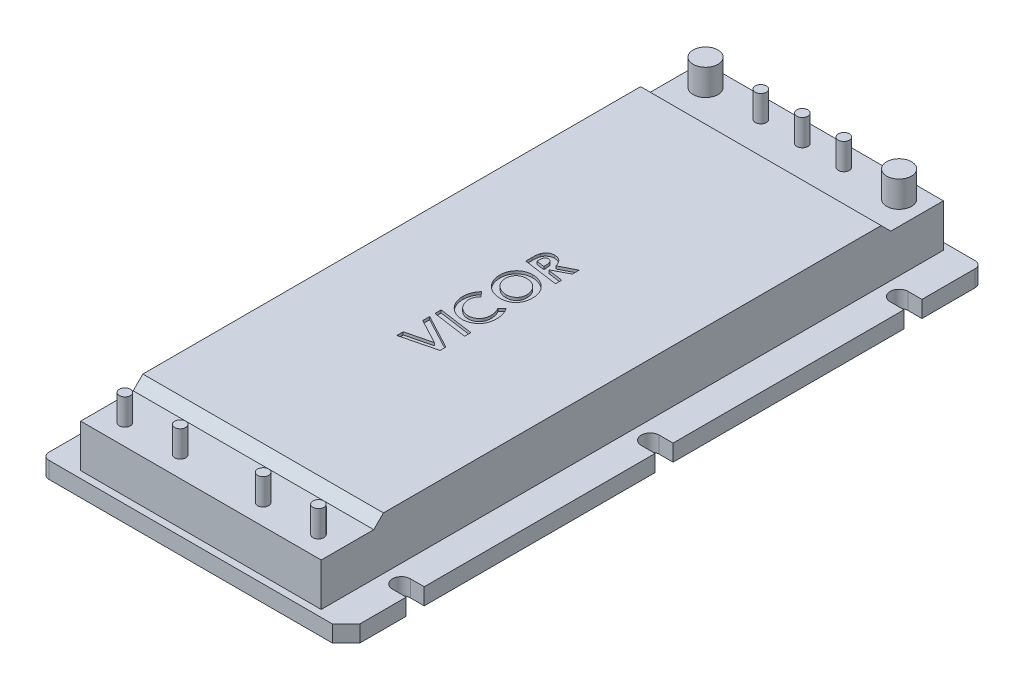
from build123d import *

# Parameters (mm, degrees)
SKETCH1_W            = 55.88
SKETCH1_H            = 116.84
EXTRUDE1_DEPTH       = 3.048
SKETCH2_W            = 44.196
SKETCH2_H            = 114.3
EXTRUDE2_DEPTH       = 9.652
CUT_EXTRUDE1_DEPTH   = 130.87425112
MIRROR3_COPY_1_DEPTH = 130.87425112
CHAMFER1_SIZE        = 2.54
FILLET1_R            = 1.27
CUT_EXTRUDE2_DEPTH   = 131.136274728
SKETCH6_R            = 1.016
SKETCH6_R_2          = 2.286
EXTRUDE4_DEPTH       = 4.826
CUT_EXTRUDE3_DEPTH   = 0.508


with BuildPart() as part:
    # Sketch1 → Extrude1 (new body)
    with BuildSketch(Plane(origin=(0, 0, 0), x_dir=(1, 0, 0), z_dir=(0, 1, 0))):
        with Locations((-27.94, 58.42)):
            Rectangle(SKETCH1_W, SKETCH1_H)
    extrude(amount=EXTRUDE1_DEPTH)

    # Sketch2 → Extrude2 (add)
    with BuildSketch(Plane(origin=(0, 3.048, 0), x_dir=(-1, 0, 0), z_dir=(0, 1, 0))):
        with Locations((27.94, -58.42)):
            Rectangle(SKETCH2_W, SKETCH2_H)
    extrude(amount=EXTRUDE2_DEPTH)

    # Sketch4 → Cut-Extrude1 (cut, through all)
    with BuildSketch(Plane(origin=(0, 3.048, 0), x_dir=(-1, 0, 0), z_dir=(0, 1, 0))):
        with BuildLine():
            Line((2.54, -56.769), (0, -56.769))
            Line((0, -56.769), (0, -60.071))
            Line((0, -60.071), (2.54, -60.071))
            ThreePointArc((2.54, -60.071), (4.191, -58.42), (2.54, -56.769))
        make_face()
        with BuildLine():
            Line((2.54, -11.049), (0, -11.049))
            Line((0, -11.049), (0, -14.351))
            Line((0, -14.351), (2.54, -14.351))
            ThreePointArc((2.54, -14.351), (4.191, -12.7), (2.54, -11.049))
        make_face()
    cut_extrude1 = extrude(amount=-CUT_EXTRUDE1_DEPTH, mode=Mode.SUBTRACT)

    # Mirror1: Cut-Extrude1 across plane
    add(cut_extrude1.mirror(Plane(origin=(0, 0, -58.42), x_dir=(1, 0, 0), z_dir=(0, 0, -1))), mode=Mode.SUBTRACT)

    # Mirror3: Cut-Extrude1 across plane
    add(cut_extrude1.mirror(Plane.ZY.offset(27.94)), mode=Mode.SUBTRACT)

    # Mirror3 copy 1 sketch → Mirror3 copy 1 (cut, through all)
    with BuildSketch(Plane(origin=(-55.88, 3.048, -116.84), x_dir=(1, 0, 0), z_dir=(0, 1, 0))):
        with BuildLine():
            Line((2.54, -56.769), (0, -56.769))
            Line((0, -56.769), (0, -60.071))
            Line((0, -60.071), (2.54, -60.071))
            ThreePointArc((2.54, -60.071), (4.191, -58.42), (2.54, -56.769))
        make_face()
        with BuildLine():
            Line((2.54, -11.049), (0, -11.049))
            Line((0, -11.049), (0, -14.351))
            Line((0, -14.351), (2.54, -14.351))
            ThreePointArc((2.54, -14.351), (4.191, -12.7), (2.54, -11.049))
        make_face()
    extrude(amount=-MIRROR3_COPY_1_DEPTH, mode=Mode.SUBTRACT)

    # Chamfer1
    chamfer1_edges = [part.edges().sort_by_distance(p)[0] for p in [
        (0, 1.524, 0),
    ]]
    chamfer(chamfer1_edges, length=CHAMFER1_SIZE)

    # Fillet1
    fillet1_edges = [part.edges().sort_by_distance(p)[0] for p in [
        (-55.88, 1.524, -116.84),
        (0, 1.524, -116.84),
        (-55.88, 1.524, 0),
    ]]
    fillet(fillet1_edges, radius=FILLET1_R)

    # Sketch5 → Cut-Extrude2 (cut, through all)
    with BuildSketch(Plane(origin=(0, 0, 0), x_dir=(0, 0, -1), z_dir=(1, 0, 0))):
        Polygon((115.57, 10.922), (105.918, 10.922), (104.14, 12.7), (115.57, 12.7), align=None)
        Polygon((1.27, 10.922), (10.922, 10.922), (12.7, 12.7), (1.27, 12.7), align=None)
    extrude(amount=-CUT_EXTRUDE2_DEPTH, mode=Mode.SUBTRACT)

    # Sketch6 → Extrude4 (add)
    with BuildSketch(Plane(origin=(0, 10.922, 0), x_dir=(-1, 0, 0), z_dir=(0, 1, 0))):
        with Locations(Location((10.16, -5.08, 0), (0, 0, 270))):
            Circle(SKETCH6_R)
        with Locations(Location((20.32, -5.08, 0), (0, 0, 270))):
            Circle(SKETCH6_R)
        with Locations(Location((35.56, -5.08, 0), (0, 0, 270))):
            Circle(SKETCH6_R)
        with Locations(Location((45.72, -5.08, 0), (0, 0, 270))):
            Circle(SKETCH6_R)
        with Locations(Location((10.16, -111.76, 0), (0, 0, 270))):
            Circle(SKETCH6_R_2)
        with Locations(Location((20.32, -111.76, 0), (0, 0, 270))):
            Circle(SKETCH6_R)
        with Locations(Location((27.94, -111.76, 0), (0, 0, 270))):
            Circle(SKETCH6_R)
        with Locations(Location((35.56, -111.76, 0), (0, 0, 270))):
            Circle(SKETCH6_R)
        with Locations(Location((45.72, -111.76, 0), (0, 0, 270))):
            Circle(SKETCH6_R_2)
    extrude(amount=EXTRUDE4_DEPTH)

    # Sketch7 → Cut-Extrude3 (cut)
    # profile 1 of 5: a face of its own
    with BuildSketch(Plane(origin=(0, 12.7, 0), x_dir=(-1, 0, 0), z_dir=(0, 1, 0))):
        Polygon((32.837963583, -42.164914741), (32.837963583, -43.337731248), (28.253548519, -44.482562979), (32.837963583, -46.915966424), (32.837963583, -48.195633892), (26.487963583, -44.823468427), (26.487963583, -43.751142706), align=None)
    # profile 2 of 5: a face of its own
    with BuildSketch(Plane(origin=(0, 12.7, 0), x_dir=(-1, 0, 0), z_dir=(0, 1, 0))):
        Polygon((32.837963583, -49.158564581), (32.837963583, -50.308484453), (26.487963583, -49.418059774), (26.487963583, -48.268139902), align=None)
    # profile 3 of 5: a face of its own
    with BuildSketch(Plane(origin=(0, 12.7, 0), x_dir=(-1, 0, 0), z_dir=(0, 1, 0))):
        with BuildLine():
            Line((32.039125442, -56.910347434), (31.251735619, -56.031371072))
            add(Edge.make_bspline(
                [(31.251735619, -56.031371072), (31.305180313, -55.98259283), (31.411859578, -55.885228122), (31.548852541, -55.716522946), (31.668091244, -55.533736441), (31.767084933, -55.33603908), (31.846150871, -55.126423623), (31.901863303, -54.906689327), (31.935876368, -54.678140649), (31.940234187, -54.522855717), (31.942450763, -54.443871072)],
                knots=[0, 0, 0, 0, 0.971056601, 1.938295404, 2.910103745, 3.898650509, 4.902833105, 5.914277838, 6.939111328, 8, 8, 8, 8], degree=3))
            add(Edge.make_bspline(
                [(31.942450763, -54.443871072), (31.941573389, -54.387861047), (31.939828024, -54.276439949), (31.922652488, -54.110236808), (31.894450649, -53.945912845), (31.856206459, -53.783234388), (31.80847846, -53.622061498), (31.746266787, -53.464233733), (31.674964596, -53.307547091), (31.594299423, -53.152864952), (31.503187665, -53.004109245), (31.40472369, -52.862544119), (31.301187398, -52.72842315), (31.188163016, -52.604566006), (31.06836794, -52.489095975), (30.943001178, -52.380015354), (30.808288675, -52.282682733), (30.669197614, -52.192006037), (30.524306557, -52.112382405), (30.376809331, -52.042559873), (30.227304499, -51.981732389), (30.07490863, -51.933805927), (29.919719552, -51.896589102), (29.762441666, -51.870367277), (29.602730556, -51.852715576), (29.495526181, -51.851035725), (29.441629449, -51.850191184)],
                knots=[0, 0, 0, 0, 1.010664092, 2.0105205, 3.012015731, 4.018149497, 5.025330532, 6.042924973, 7.077217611, 8.131560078, 9.189451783, 10.223319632, 11.24289783, 12.245211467, 13.246472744, 14.245068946, 15.241551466, 16.24351444, 17.240320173, 18.222803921, 19.187753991, 20.151063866, 21.103305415, 22.065794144, 23.027582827, 24, 24, 24, 24], degree=3))
            add(Edge.make_bspline(
                [(29.441629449, -51.850191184), (29.369432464, -51.851593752), (29.227384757, -51.854353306), (29.019280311, -51.885322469), (28.820010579, -51.931416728), (28.630239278, -51.998131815), (28.450383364, -52.084171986), (28.278316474, -52.186969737), (28.118174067, -52.31205428), (27.96700089, -52.452158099), (27.830685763, -52.608079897), (27.709671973, -52.775177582), (27.609426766, -52.954515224), (27.525654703, -53.14370789), (27.462563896, -53.344452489), (27.417023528, -53.555201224), (27.387935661, -53.776514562), (27.384984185, -53.927756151), (27.383476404, -54.005018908)],
                knots=[0, 0, 0, 0, 1.037508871, 2.041300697, 3.018951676, 3.975513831, 4.927438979, 5.88223082, 6.851861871, 7.844178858, 8.842305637, 9.825493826, 10.805727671, 11.791408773, 12.796144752, 13.825955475, 14.88937509, 16, 16, 16, 16], degree=3))
            add(Edge.make_bspline(
                [(27.383476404, -54.005018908), (27.384891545, -54.088179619), (27.387676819, -54.251856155), (27.411183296, -54.492824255), (27.448987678, -54.724951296), (27.502615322, -54.94857719), (27.571418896, -55.164173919), (27.655123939, -55.371471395), (27.754506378, -55.570322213), (27.832752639, -55.695296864), (27.871937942, -55.757883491)],
                knots=[0, 0, 0, 0, 1.080964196, 2.127548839, 3.144369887, 4.136458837, 5.11448058, 6.083888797, 7.040421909, 8, 8, 8, 8], degree=3))
            Line((27.871937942, -55.757883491), (27.085820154, -56.47149527))
            add(Edge.make_bspline(
                [(27.085820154, -56.47149527), (27.02496099, -56.380410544), (26.903576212, -56.198740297), (26.74876303, -55.910510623), (26.618808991, -55.611472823), (26.51175709, -55.302720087), (26.427137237, -54.983523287), (26.368005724, -54.653413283), (26.331182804, -54.312420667), (26.32717516, -54.081435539), (26.325143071, -53.96431378)],
                knots=[0, 0, 0, 0, 0.987115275, 1.968820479, 2.944554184, 3.923725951, 4.912076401, 5.918257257, 6.944445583, 8, 8, 8, 8], degree=3))
            add(Edge.make_bspline(
                [(26.325143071, -53.96431378), (26.326408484, -53.882445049), (26.328896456, -53.721480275), (26.347158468, -53.484996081), (26.37573065, -53.257629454), (26.418065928, -53.039824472), (26.471148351, -52.831133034), (26.535983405, -52.631587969), (26.613544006, -52.442034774), (26.703393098, -52.261694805), (26.803274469, -52.089853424), (26.916225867, -51.927470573), (27.040017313, -51.773701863), (27.173069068, -51.626730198), (27.319040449, -51.490365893), (27.476237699, -51.362943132), (27.644033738, -51.243533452), (27.821431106, -51.133168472), (28.006699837, -51.034142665), (28.197304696, -50.948098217), (28.391089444, -50.873553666), (28.589151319, -50.81343052), (28.791262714, -50.768168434), (28.997255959, -50.734981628), (29.206704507, -50.713769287), (29.3478728, -50.711557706), (29.418732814, -50.710447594)],
                knots=[0, 0, 0, 0, 1.169384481, 2.299164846, 3.386265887, 4.441115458, 5.466513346, 6.460610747, 7.435799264, 8.389283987, 9.33668929, 10.272542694, 11.211859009, 12.155072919, 13.102071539, 14.062227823, 15.043753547, 16.042122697, 17.044727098, 18.042269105, 19.027674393, 20.008714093, 20.996146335, 21.983950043, 22.988035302, 24, 24, 24, 24], degree=3))
            add(Edge.make_bspline(
                [(29.418732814, -50.710447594), (29.49512415, -50.711781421), (29.647444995, -50.714441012), (29.874746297, -50.740089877), (30.099654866, -50.778891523), (30.322160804, -50.834437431), (30.542347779, -50.903634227), (30.759279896, -50.991550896), (30.974796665, -51.092817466), (31.185661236, -51.211330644), (31.390968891, -51.340669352), (31.585082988, -51.484222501), (31.7681578, -51.638478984), (31.941916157, -51.802066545), (32.102501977, -51.97854592), (32.251590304, -52.166289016), (32.390214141, -52.364601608), (32.517260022, -52.573173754), (32.631443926, -52.789091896), (32.729391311, -53.011790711), (32.813779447, -53.238389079), (32.883007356, -53.470255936), (32.934466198, -53.707746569), (32.972948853, -53.949741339), (32.996413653, -54.196631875), (32.999321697, -54.362834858), (33.000784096, -54.446415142)],
                knots=[0, 0, 0, 0, 0.957938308, 1.910085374, 2.865865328, 3.819200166, 4.784757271, 5.758629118, 6.753154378, 7.769862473, 8.790943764, 9.79519293, 10.795617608, 11.792643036, 12.786584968, 13.785892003, 14.798124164, 15.81980098, 16.847620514, 17.859684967, 18.869440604, 19.879196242, 20.892266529, 21.915382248, 22.951685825, 24, 24, 24, 24], degree=3))
            add(Edge.make_bspline(
                [(33.000784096, -54.446415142), (32.997813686, -54.563158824), (32.991948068, -54.793690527), (32.946500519, -55.133205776), (32.871589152, -55.46087076), (32.765091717, -55.776240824), (32.630258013, -56.08047503), (32.463571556, -56.371556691), (32.267269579, -56.650713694), (32.11582425, -56.82306227), (32.039125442, -56.910347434)],
                knots=[0, 0, 0, 0, 1.033545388, 2.040923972, 3.027343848, 4.005734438, 4.983995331, 5.969464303, 6.971644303, 8, 8, 8, 8], degree=3))
        make_face()
    # profile 4 of 5: a face of its own
    with BuildSketch(Plane(origin=(0, 12.7, 0), x_dir=(-1, 0, 0), z_dir=(0, 1, 0))):
        with BuildLine():
            add(Edge.make_bspline(
                [(33.000784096, -61.287420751), (32.998538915, -61.39439979), (32.994130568, -61.604449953), (32.953563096, -61.912338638), (32.888176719, -62.206070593), (32.794414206, -62.484930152), (32.675961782, -62.749988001), (32.529984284, -63.000606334), (32.357512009, -63.236511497), (32.160881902, -63.455782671), (31.944230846, -63.654400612), (31.712346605, -63.830532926), (31.464174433, -63.976808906), (31.202477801, -64.097271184), (30.926970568, -64.192230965), (30.636328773, -64.257007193), (30.332478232, -64.299764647), (30.124862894, -64.303869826), (30.019133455, -64.305960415)],
                knots=[0, 0, 0, 0, 1.079937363, 2.120424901, 3.130164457, 4.114608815, 5.086352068, 6.057283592, 7.037967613, 8.032612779, 9.026667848, 10.002130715, 10.967845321, 11.92966918, 12.907375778, 13.904589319, 14.932898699, 16, 16, 16, 16], degree=3))
            add(Edge.make_bspline(
                [(30.019133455, -64.305960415), (29.936813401, -64.304621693), (29.773085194, -64.301959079), (29.529639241, -64.276617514), (29.289642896, -64.237151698), (29.053051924, -64.183066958), (28.82053162, -64.11084246), (28.591220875, -64.02405565), (28.364546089, -63.922952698), (28.144472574, -63.804101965), (27.93144365, -63.674883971), (27.731391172, -63.531162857), (27.542763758, -63.378777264), (27.366698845, -63.216070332), (27.204914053, -63.041769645), (27.054139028, -62.859114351), (26.917769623, -62.664192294), (26.793209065, -62.460085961), (26.682507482, -62.246371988), (26.586827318, -62.024493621), (26.506829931, -61.794739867), (26.440692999, -61.557653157), (26.388077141, -61.312647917), (26.35173011, -61.059769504), (26.329671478, -60.798929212), (26.326667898, -60.622613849), (26.325143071, -60.533103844)],
                knots=[0, 0, 0, 0, 1.005275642, 1.999415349, 2.986283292, 3.975052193, 4.961308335, 5.957900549, 6.968658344, 7.990515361, 9.011164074, 10.010028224, 10.996882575, 11.971758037, 12.935522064, 13.89977307, 14.862534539, 15.838743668, 16.81862813, 17.799989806, 18.787727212, 19.788027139, 20.804884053, 21.846462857, 22.906713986, 24, 24, 24, 24], degree=3))
            add(Edge.make_bspline(
                [(26.325143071, -60.533103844), (26.327425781, -60.422315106), (26.331883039, -60.205987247), (26.371262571, -59.89070813), (26.43271737, -59.592392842), (26.520799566, -59.311095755), (26.633867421, -59.046388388), (26.773869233, -58.799649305), (26.936941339, -58.56898441), (27.12580511, -58.358575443), (27.33356056, -58.167732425), (27.559460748, -58.001486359), (27.802222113, -57.862101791), (28.060014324, -57.747234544), (28.334133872, -57.657813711), (28.623929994, -57.594914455), (28.929623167, -57.555744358), (29.138764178, -57.551222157), (29.245736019, -57.548909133)],
                knots=[0, 0, 0, 0, 1.129241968, 2.204975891, 3.234368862, 4.231206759, 5.205369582, 6.163669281, 7.118588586, 8.080101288, 9.040991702, 9.990463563, 10.93374344, 11.889836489, 12.863289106, 13.868232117, 14.909639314, 16, 16, 16, 16], degree=3))
            add(Edge.make_bspline(
                [(29.245736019, -57.548909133), (29.368011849, -57.551683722), (29.608779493, -57.557147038), (29.963186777, -57.605172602), (30.305285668, -57.678580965), (30.633258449, -57.78674471), (30.948349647, -57.923154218), (31.249510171, -58.091166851), (31.539182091, -58.288179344), (31.717442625, -58.44177584), (31.807615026, -58.519472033)],
                knots=[0, 0, 0, 0, 1.045740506, 2.05911896, 3.05467723, 4.035585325, 5.008815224, 5.988058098, 6.982266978, 8, 8, 8, 8], degree=3))
            add(Edge.make_bspline(
                [(31.807615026, -58.519472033), (31.856505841, -58.564701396), (31.953407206, -58.654345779), (32.088069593, -58.797815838), (32.214144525, -58.944798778), (32.330143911, -59.097371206), (32.438730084, -59.253243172), (32.536597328, -59.414845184), (32.624193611, -59.581422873), (32.705514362, -59.751105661), (32.773076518, -59.9279394), (32.834901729, -60.107840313), (32.885506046, -60.29322852), (32.927472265, -60.482988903), (32.960819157, -60.677352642), (32.983204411, -60.876564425), (32.997689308, -61.080289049), (32.999744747, -61.217857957), (33.000784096, -61.287420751)],
                knots=[0, 0, 0, 0, 1.027802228, 2.037099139, 3.035235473, 4.015726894, 4.994294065, 5.966360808, 6.929640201, 7.898771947, 8.868676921, 9.849736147, 10.834217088, 11.833061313, 12.848810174, 13.876612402, 14.926292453, 16, 16, 16, 16], degree=3))
        make_face()
        with BuildLine():
            add(Edge.make_bspline(
                [(31.942450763, -61.260708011), (31.94158844, -61.203000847), (31.939872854, -61.0881929), (31.922606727, -60.918266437), (31.895884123, -60.751747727), (31.859155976, -60.589387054), (31.812252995, -60.430599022), (31.752775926, -60.276395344), (31.685028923, -60.12480392), (31.604014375, -59.97900326), (31.515485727, -59.837229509), (31.416131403, -59.702676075), (31.307430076, -59.574650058), (31.189170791, -59.454033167), (31.06170496, -59.340508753), (30.924848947, -59.234905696), (30.779389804, -59.135157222), (30.625376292, -59.043419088), (30.466331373, -58.959726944), (30.304778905, -58.88740331), (30.142335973, -58.825414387), (29.978004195, -58.776378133), (29.812540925, -58.73631462), (29.64548417, -58.708542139), (29.477190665, -58.691296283), (29.364500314, -58.689534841), (29.308065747, -58.688652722)],
                knots=[0, 0, 0, 0, 1.015666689, 2.020660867, 3.003679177, 3.983404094, 4.949381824, 5.915705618, 6.891212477, 7.870055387, 8.849666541, 9.832089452, 10.811814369, 11.80422627, 12.803548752, 13.81443089, 14.845561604, 15.90686591, 16.968668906, 18.007820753, 19.021317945, 20.027337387, 21.024985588, 22.016582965, 23.006718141, 24, 24, 24, 24], degree=3))
            add(Edge.make_bspline(
                [(29.308065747, -58.688652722), (29.242282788, -58.690099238), (29.112851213, -58.692945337), (28.922004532, -58.716063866), (28.73926732, -58.755889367), (28.563255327, -58.808686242), (28.39656774, -58.879768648), (28.236063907, -58.963421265), (28.084577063, -59.064917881), (27.941229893, -59.179860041), (27.809412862, -59.308870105), (27.696088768, -59.454095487), (27.598216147, -59.611433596), (27.519265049, -59.783313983), (27.458257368, -59.968580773), (27.415692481, -60.167330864), (27.388163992, -60.378842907), (27.385065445, -60.524534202), (27.383476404, -60.599249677)],
                knots=[0, 0, 0, 0, 1.032788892, 2.032068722, 3.012810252, 3.966881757, 4.912857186, 5.854016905, 6.805040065, 7.771048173, 8.736206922, 9.693919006, 10.656594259, 11.63966092, 12.656618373, 13.71317118, 14.827236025, 16, 16, 16, 16], degree=3))
            add(Edge.make_bspline(
                [(27.383476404, -60.599249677), (27.385541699, -60.686715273), (27.389619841, -60.859425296), (27.42598286, -61.113095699), (27.486250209, -61.356647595), (27.569070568, -61.590275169), (27.67508839, -61.814352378), (27.805751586, -62.027831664), (27.960679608, -62.23054351), (28.136501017, -62.420845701), (28.327810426, -62.595999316), (28.53364395, -62.747331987), (28.748624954, -62.877415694), (28.97417635, -62.983114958), (29.210030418, -63.064997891), (29.455887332, -63.123344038), (29.711881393, -63.160170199), (29.886292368, -63.164184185), (29.974612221, -63.166216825)],
                knots=[0, 0, 0, 0, 1.033598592, 2.040949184, 3.022066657, 3.995535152, 4.96641903, 5.947331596, 6.94889108, 7.977677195, 9.006780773, 10.010345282, 10.992947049, 11.972898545, 12.949433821, 13.93910636, 14.956385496, 16, 16, 16, 16], degree=3))
            add(Edge.make_bspline(
                [(29.974612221, -63.166216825), (30.047207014, -63.165058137), (30.189476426, -63.16278737), (30.396563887, -63.136054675), (30.593270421, -63.096419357), (30.77786255, -63.037252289), (30.952349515, -62.963327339), (31.115764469, -62.873260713), (31.266966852, -62.764900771), (31.406749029, -62.642094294), (31.531744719, -62.505003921), (31.642657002, -62.357775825), (31.735556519, -62.199820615), (31.81096547, -62.031047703), (31.870973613, -61.853165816), (31.913069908, -61.664322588), (31.936848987, -61.465694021), (31.94056034, -61.329884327), (31.942450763, -61.260708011)],
                knots=[0, 0, 0, 0, 1.128567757, 2.211738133, 3.242724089, 4.246080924, 5.221271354, 6.186710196, 7.142070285, 8.10939985, 9.075739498, 10.022890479, 10.971968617, 11.919601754, 12.893653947, 13.887360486, 14.92390141, 16, 16, 16, 16], degree=3))
        make_face(mode=Mode.SUBTRACT)
    # profile 5 of 5: a face of its own
    with BuildSketch(Plane(origin=(0, 12.7, 0), x_dir=(-1, 0, 0), z_dir=(0, 1, 0))):
        with BuildLine():
            Line((32.837963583, -65.847667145), (32.837963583, -66.950521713))
            add(Edge.make_bspline(
                [(32.837963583, -66.950521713), (32.837629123, -67.032365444), (32.836984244, -67.190169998), (32.82781407, -67.417098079), (32.813979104, -67.625379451), (32.795721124, -67.81476646), (32.770389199, -67.985417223), (32.739973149, -68.136976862), (32.706100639, -68.270413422), (32.674624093, -68.350434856), (32.659878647, -68.387921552)],
                knots=[0, 0, 0, 0, 1.348808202, 2.600664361, 3.742342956, 4.788858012, 5.735658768, 6.584006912, 7.336666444, 8, 8, 8, 8], degree=3))
            add(Edge.make_bspline(
                [(32.659878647, -68.387921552), (32.640848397, -68.43012878), (32.603647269, -68.51263723), (32.540549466, -68.630832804), (32.472727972, -68.741645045), (32.396739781, -68.842887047), (32.318575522, -68.938373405), (32.232031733, -69.023262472), (32.142522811, -69.102697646), (32.046280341, -69.172664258), (31.946106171, -69.235045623), (31.841156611, -69.289014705), (31.731095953, -69.333396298), (31.616663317, -69.370028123), (31.497832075, -69.399952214), (31.37434665, -69.419434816), (31.246530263, -69.433108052), (31.15976318, -69.434233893), (31.115627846, -69.434806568)],
                knots=[0, 0, 0, 0, 1.116127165, 2.18185197, 3.228774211, 4.245094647, 5.232142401, 6.200910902, 7.164648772, 8.115556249, 9.066023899, 10.007984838, 10.95729697, 11.924067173, 12.903566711, 13.908717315, 14.936238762, 16, 16, 16, 16], degree=3))
            add(Edge.make_bspline(
                [(31.115627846, -69.434806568), (31.061316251, -69.433460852), (30.95409637, -69.43080419), (30.795980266, -69.413463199), (30.64427437, -69.381067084), (30.498393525, -69.337614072), (30.357966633, -69.283220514), (30.223786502, -69.215456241), (30.095947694, -69.134495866), (29.973711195, -69.041886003), (29.859281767, -68.936483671), (29.753969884, -68.817804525), (29.657501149, -68.687237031), (29.571088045, -68.54313579), (29.49148896, -68.388118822), (29.423912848, -68.218907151), (29.361591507, -68.038521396), (29.330394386, -67.912044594), (29.314425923, -67.847306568)],
                knots=[0, 0, 0, 0, 0.995319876, 1.964922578, 2.909737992, 3.8340754, 4.751759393, 5.665652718, 6.58399436, 7.521078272, 8.472357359, 9.429930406, 10.424522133, 11.442601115, 12.505929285, 13.614075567, 14.778748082, 16, 16, 16, 16], degree=3))
            Line((29.314425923, -67.847306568), (26.487963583, -69.312691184))
            Line((26.487963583, -69.312691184), (26.487963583, -68.039383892))
            Line((26.487963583, -68.039383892), (29.255912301, -66.604528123))
            Line((29.255912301, -66.604528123), (29.255912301, -66.496405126))
            Line((29.255912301, -66.496405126), (26.487963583, -66.107162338))
            Line((26.487963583, -66.107162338), (26.487963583, -64.957242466))
            Line((26.487963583, -64.957242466), (32.837963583, -65.847667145))
        make_face()
        with BuildLine():
            add(Edge.make_bspline(
                [(30.314245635, -66.645233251), (30.31500562, -66.727079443), (30.316459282, -66.883630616), (30.326570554, -67.107216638), (30.342542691, -67.308839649), (30.365367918, -67.487918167), (30.392361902, -67.644923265), (30.426061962, -67.779187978), (30.466130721, -67.891327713), (30.513648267, -67.983111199), (30.569438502, -68.057462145), (30.628975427, -68.121816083), (30.695620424, -68.175402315), (30.768254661, -68.219615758), (30.847028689, -68.25371613), (30.932476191, -68.27830777), (31.024027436, -68.291904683), (31.087176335, -68.293994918), (31.119443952, -68.295062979)],
                knots=[0, 0, 0, 0, 1.892208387, 3.619318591, 5.173427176, 6.566868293, 7.791773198, 8.8545744, 9.763297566, 10.539470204, 11.233547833, 11.906251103, 12.5615143, 13.203742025, 13.866659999, 14.539934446, 15.25394049, 16, 16, 16, 16], degree=3))
            add(Edge.make_bspline(
                [(31.119443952, -68.295062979), (31.156079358, -68.293863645), (31.227243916, -68.291533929), (31.328728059, -68.265806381), (31.422211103, -68.22847102), (31.504780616, -68.172345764), (31.576014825, -68.101643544), (31.637597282, -68.017643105), (31.683065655, -67.917975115), (31.715117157, -67.825468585), (31.732885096, -67.737830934), (31.74502835, -67.655850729), (31.756778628, -67.558342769), (31.765225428, -67.445868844), (31.77111177, -67.318175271), (31.776591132, -67.175713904), (31.778582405, -67.017944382), (31.779270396, -66.907696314), (31.77963025, -66.850030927)],
                knots=[0, 0, 0, 0, 0.974566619, 1.893103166, 2.774869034, 3.646503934, 4.533832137, 5.440606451, 6.40634732, 7.443055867, 8.043908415, 8.787358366, 9.65251809, 10.661742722, 11.793623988, 13.060556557, 14.462520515, 16, 16, 16, 16], degree=3))
            Line((31.77963025, -66.850030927), (30.314245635, -66.645233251))
        make_face(mode=Mode.SUBTRACT)
    extrude(amount=-CUT_EXTRUDE3_DEPTH, mode=Mode.SUBTRACT)


solid = part.part
